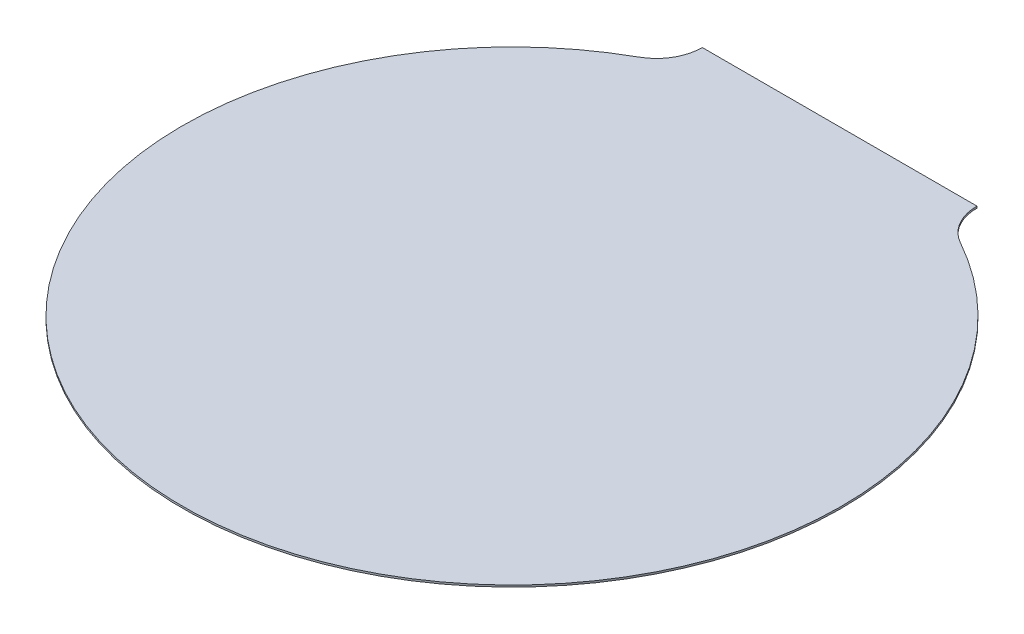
from build123d import *

# Parameters (mm, degrees)
EXTRUDE1_DEPTH = 0.0508


with BuildPart() as part:
    # Sketch1 → Extrude1 (new body)
    with BuildSketch(Plane(origin=(0, 0, 0), x_dir=(1, 0, 0), z_dir=(0, 1, 0))):
        with BuildLine():
            Line((3.8096924, 9.091101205), (-3.8096924, 9.091101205))
            ThreePointArc((-3.8096924, 9.091101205), (-3.984331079, 8.448385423), (-4.460217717, 7.982430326))
            ThreePointArc((-4.460217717, 7.982430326), (0, -9.144), (4.460217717, 7.982430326))
            ThreePointArc((4.460217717, 7.982430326), (3.984331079, 8.448385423), (3.8096924, 9.091101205))
        make_face()
    extrude(amount=EXTRUDE1_DEPTH)


solid = part.part
